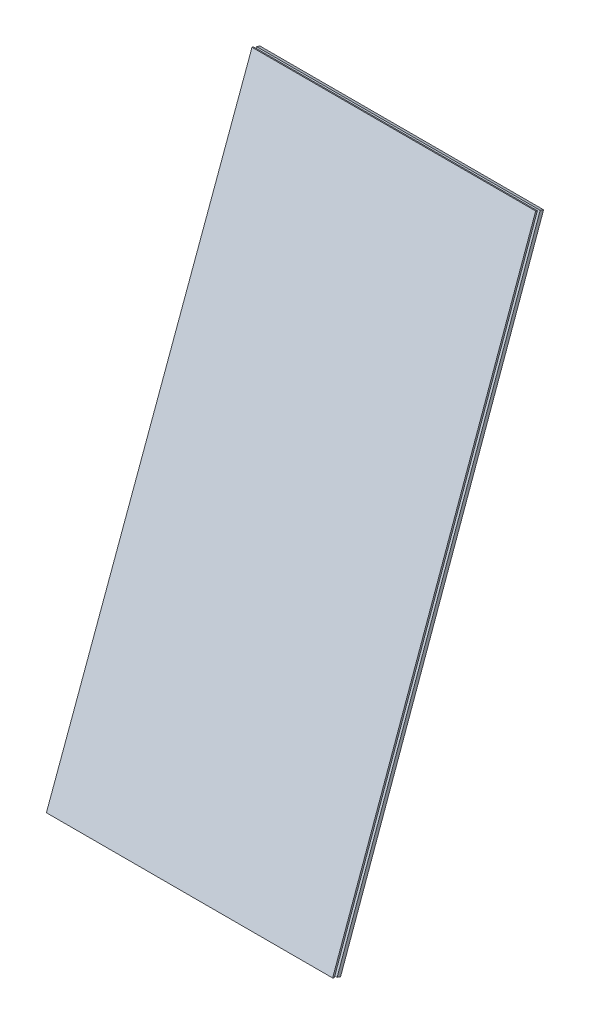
from build123d import *

# Parameters (mm, degrees)
BOSS_EXTRUDE1_DEPTH = 20
BOSS_EXTRUDE2_DEPTH = 10


with BuildPart() as part:
    # Sketch2 → Boss-Extrude1 (new body)
    with BuildSketch(Plane(origin=(0, 2.05212086, 5.638155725), x_dir=(1, 0, 0), z_dir=(0, 0.34202014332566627, 0.9396926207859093))):
        Polygon((0, 0), (1557, 0), (1550, 3249.99246153), (7, 3249.99246153), align=None)
    extrude(amount=BOSS_EXTRUDE1_DEPTH)


with BuildPart() as body_2:
    # Sketch3 → Boss-Extrude2 (new body)
    with BuildSketch(Plane(origin=(0, 14.36484602, 39.467090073), x_dir=(1, 0, 0), z_dir=(0, 0.3420201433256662, 0.9396926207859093))):
        Polygon((0, 0), (1557, 0), (1550, 3249.99246153), (7, 3249.99246153), align=None)
    extrude(amount=BOSS_EXTRUDE2_DEPTH)


solid = Compound([part.part, body_2.part])
